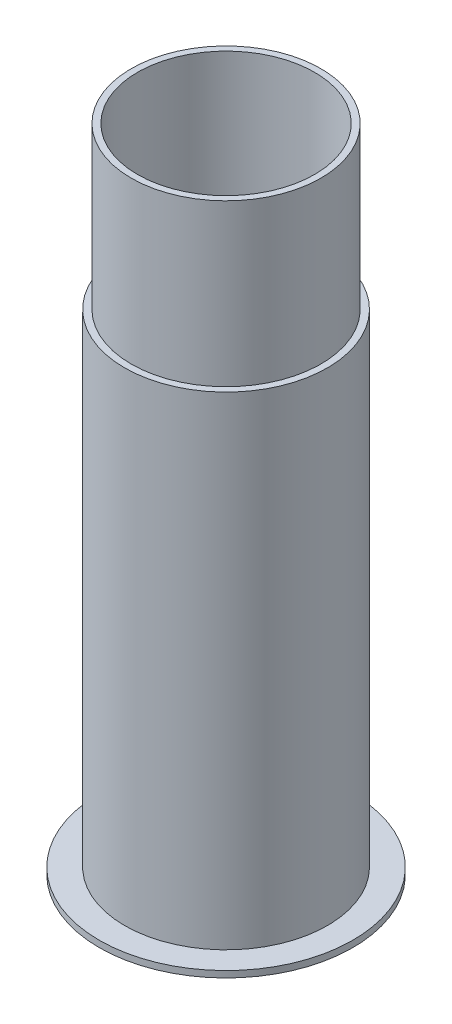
from build123d import *

# Parameters (mm, degrees)
SKETCH1_R      = 5
EXTRUDE1_DEPTH = 0.254
SKETCH2_R      = 4
EXTRUDE2_DEPTH = 19.05
SKETCH14_R     = 3.741000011
EXTRUDE5_DEPTH = 6.35
SKETCH15_R     = 3.4925
EXTRUDE6_DEPTH = 27.610669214


with BuildPart() as part:
    # Sketch1 → Extrude1 (new body)
    with BuildSketch(Plane(origin=(0, 0, 0), x_dir=(1, 0, 0), z_dir=(0, 1, 0))):
        with Locations(Location((0, 0, 0), (0, 0, 270))):
            Circle(SKETCH1_R)
    extrude(amount=EXTRUDE1_DEPTH)

    # Sketch2 → Extrude2 (add)
    with BuildSketch(Plane(origin=(0, 0.254, 0), x_dir=(1, 0, 0), z_dir=(0, 1, 0))):
        with Locations(Location((0, 0, 0), (0, 0, 270))):
            Circle(SKETCH2_R)
    extrude(amount=EXTRUDE2_DEPTH)

    # Sketch14 → Extrude5 (add)
    with BuildSketch(Plane(origin=(0, 19.304, 0), x_dir=(-1, 0, 0), z_dir=(0, 1, 0))):
        with Locations(Location((0, 0, 0), (0, 0, 90))):
            Circle(SKETCH14_R)
    extrude(amount=EXTRUDE5_DEPTH)

    # Sketch15 → Extrude6 (cut, through all)
    with BuildSketch(Plane(origin=(0, 25.654, 0), x_dir=(1, 0, 0), z_dir=(0, 1, 0))):
        with Locations(Location((0, 0, 0), (0, 0, 270))):
            Circle(SKETCH15_R)
    extrude(amount=-EXTRUDE6_DEPTH, mode=Mode.SUBTRACT)


solid = part.part
